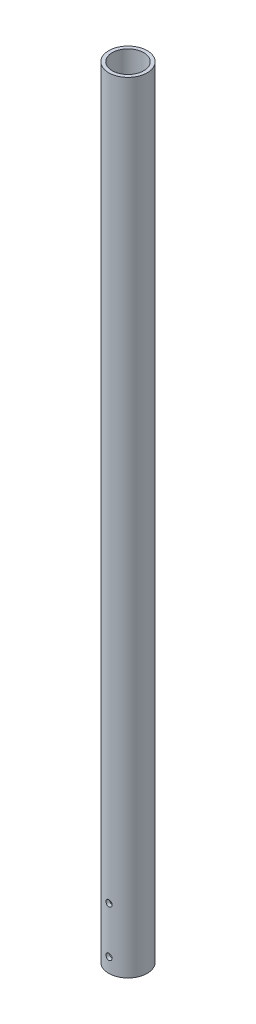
from build123d import *

# Parameters (mm, degrees)
SKETCH1_R               = 21.082
SKETCH1_R_2             = 17.272
BOSS_EXTRUDE1_DEPTH     = 855.6625
F_1_4_CLEARANCE_HOLE1_D = 6.7564


with BuildPart() as part:
    # Sketch1 → Boss-Extrude1 (new body)
    with BuildSketch(Plane(origin=(0, 0, 0), x_dir=(1, 0, 0), z_dir=(0, 1, 0))):
        with Locations(Location((0, 0, 0), (0, 0, 270))):
            Circle(SKETCH1_R)
        with Locations(Location((0, 0, 0), (0, 0, 270))):
            Circle(SKETCH1_R_2, mode=Mode.SUBTRACT)
    extrude(amount=BOSS_EXTRUDE1_DEPTH)

    # 1_4 Clearance Hole1 (through all)
    with Locations(Plane.XY.offset(21.082)):
        with Locations((0, 15.875), (0, 66.675)):
            Hole(F_1_4_CLEARANCE_HOLE1_D / 2)


solid = part.part
